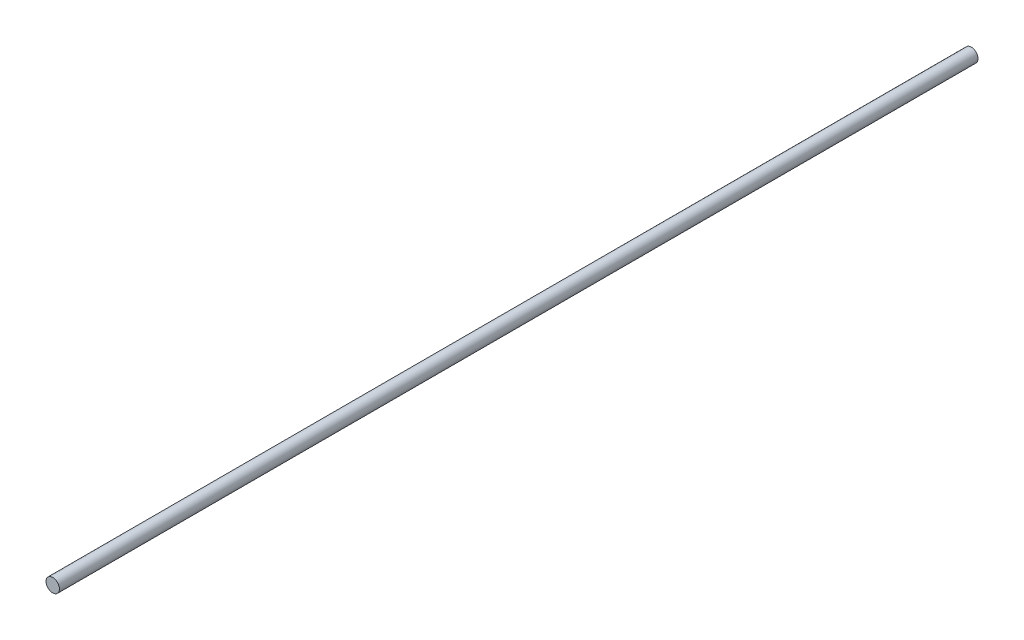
ISO-10303-21;
HEADER;
FILE_DESCRIPTION(('STEP AP214'),'2;1');
FILE_NAME('part.step','',(''),(''),'','','');
FILE_SCHEMA(('AUTOMOTIVE_DESIGN { 1 0 10303 214 1 1 1 1 }'));
ENDSEC;
DATA;
#1=APPLICATION_CONTEXT('core data for automotive mechanical design processes');
#2=APPLICATION_PROTOCOL_DEFINITION('international standard','automotive_design',2000,#1);
#3=PRODUCT_CONTEXT('',#1,'mechanical');
#4=PRODUCT('Part','Part','',(#3));
#5=PRODUCT_RELATED_PRODUCT_CATEGORY('part','',(#4));
#6=PRODUCT_DEFINITION_FORMATION('','',#4);
#7=PRODUCT_DEFINITION_CONTEXT('part definition',#1,'design');
#8=PRODUCT_DEFINITION('design','',#6,#7);
#9=PRODUCT_DEFINITION_SHAPE('','',#8);
#10=(LENGTH_UNIT() NAMED_UNIT(*) SI_UNIT(.MILLI.,.METRE.));
#11=(NAMED_UNIT(*) PLANE_ANGLE_UNIT() SI_UNIT($,.RADIAN.));
#12=(NAMED_UNIT(*) SI_UNIT($,.STERADIAN.) SOLID_ANGLE_UNIT());
#13=UNCERTAINTY_MEASURE_WITH_UNIT(LENGTH_MEASURE(1.E-05),#10,'distance_accuracy_value','');
#14=(GEOMETRIC_REPRESENTATION_CONTEXT(3) GLOBAL_UNCERTAINTY_ASSIGNED_CONTEXT((#13)) GLOBAL_UNIT_ASSIGNED_CONTEXT((#10,
#11,#12)) REPRESENTATION_CONTEXT('',''));
#15=CARTESIAN_POINT('',(0.,0.,0.));
#16=DIRECTION('',(0.,0.,1.));
#17=DIRECTION('',(1.,0.,0.));
#18=AXIS2_PLACEMENT_3D('',#15,#16,#17);
#19=CARTESIAN_POINT('',(0.,0.,-4100.));
#20=DIRECTION('',(0.,0.,1.));
#21=DIRECTION('',(1.,0.,0.));
#22=AXIS2_PLACEMENT_3D('',#19,#20,#21);
#23=CYLINDRICAL_SURFACE('',#22,30.);
#24=CARTESIAN_POINT('',(0.,0.,-4100.));
#25=DIRECTION('',(0.,0.,1.));
#26=DIRECTION('',(1.,0.,0.));
#27=AXIS2_PLACEMENT_3D('',#24,#25,#26);
#28=CIRCLE('',#27,30.);
#29=CARTESIAN_POINT('',(30.,0.,-4100.));
#30=VERTEX_POINT('',#29);
#31=EDGE_CURVE('E10',#30,#30,#28,.T.);
#32=ORIENTED_EDGE('',*,*,#31,.T.);
#33=EDGE_LOOP('',(#32));
#34=FACE_BOUND('',#33,.T.);
#35=CARTESIAN_POINT('',(0.,0.,0.));
#36=DIRECTION('',(0.,0.,1.));
#37=DIRECTION('',(1.,0.,0.));
#38=AXIS2_PLACEMENT_3D('',#35,#36,#37);
#39=CIRCLE('',#38,30.);
#40=CARTESIAN_POINT('',(30.,0.,0.));
#41=VERTEX_POINT('',#40);
#42=EDGE_CURVE('E40',#41,#41,#39,.T.);
#43=ORIENTED_EDGE('',*,*,#42,.F.);
#44=EDGE_LOOP('',(#43));
#45=FACE_BOUND('',#44,.T.);
#46=ADVANCED_FACE('F37',(#34,#45),#23,.T.);
#47=CARTESIAN_POINT('',(0.,0.,-4100.));
#48=DIRECTION('',(0.,0.,1.));
#49=DIRECTION('',(1.,0.,0.));
#50=AXIS2_PLACEMENT_3D('',#47,#48,#49);
#51=PLANE('',#50);
#52=ORIENTED_EDGE('',*,*,#31,.F.);
#53=EDGE_LOOP('',(#52));
#54=FACE_BOUND('',#53,.T.);
#55=ADVANCED_FACE('F54',(#54),#51,.F.);
#56=CARTESIAN_POINT('',(0.,0.,0.));
#57=DIRECTION('',(0.,0.,1.));
#58=DIRECTION('',(1.,0.,0.));
#59=AXIS2_PLACEMENT_3D('',#56,#57,#58);
#60=PLANE('',#59);
#61=ORIENTED_EDGE('',*,*,#42,.T.);
#62=EDGE_LOOP('',(#61));
#63=FACE_BOUND('',#62,.T.);
#64=ADVANCED_FACE('F51',(#63),#60,.T.);
#65=CLOSED_SHELL('',(#46,#55,#64));
#66=MANIFOLD_SOLID_BREP('B2',#65);
#67=ADVANCED_BREP_SHAPE_REPRESENTATION('',(#18,#66),#14);
#68=SHAPE_DEFINITION_REPRESENTATION(#9,#67);
ENDSEC;
END-ISO-10303-21;
